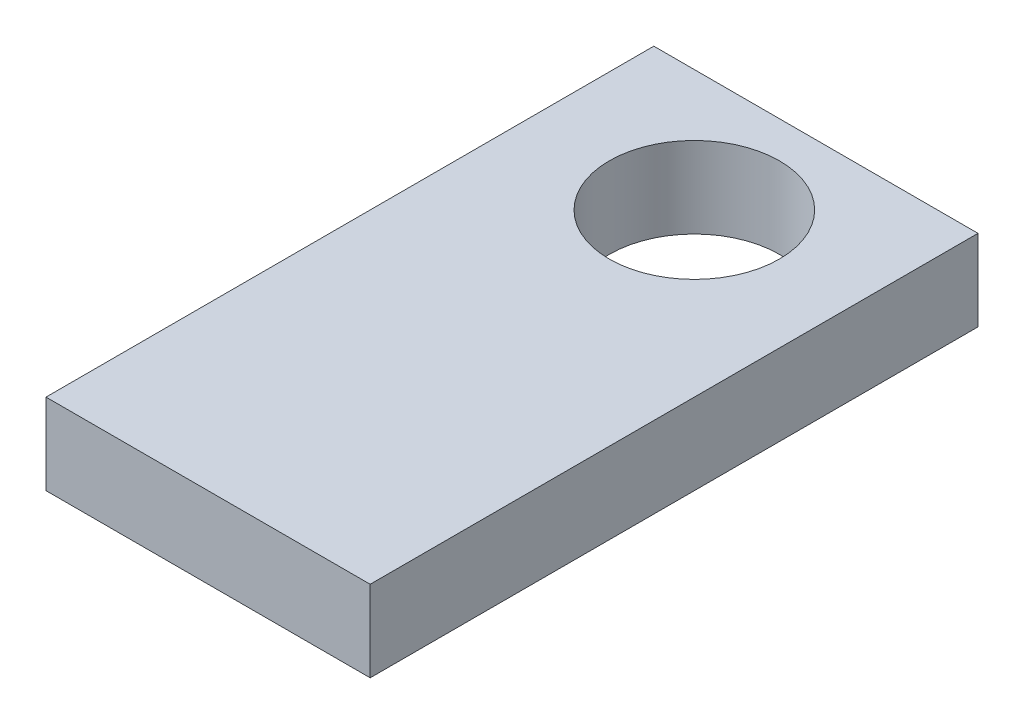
from build123d import *

# Parameters (mm, degrees)
ESQUISSE1_W             = 80
ESQUISSE1_H             = 20
BASE_EXTRUSION_DEPTH    = 150
ESQUISSE2_R             = 21
ENL_V_MAT_EXTRU_1_DEPTH = 172.172427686


with BuildPart() as part:
    # Esquisse1 → Base-Extrusion (new body)
    with BuildSketch(Plane.XY):
        with Locations((40, 10)):
            Rectangle(ESQUISSE1_W, ESQUISSE1_H)
    extrude(amount=BASE_EXTRUSION_DEPTH)

    # Esquisse2 → Enl_v. mat.-Extru.1 (cut, through all)
    with BuildSketch(Plane(origin=(0, 20, 0), x_dir=(-1, 0, 0), z_dir=(0, 1, 0))):
        with Locations(Location((-40, 30, 0), (0, 0, 90))):
            Circle(ESQUISSE2_R)
    extrude(amount=-ENL_V_MAT_EXTRU_1_DEPTH, mode=Mode.SUBTRACT)


solid = part.part
